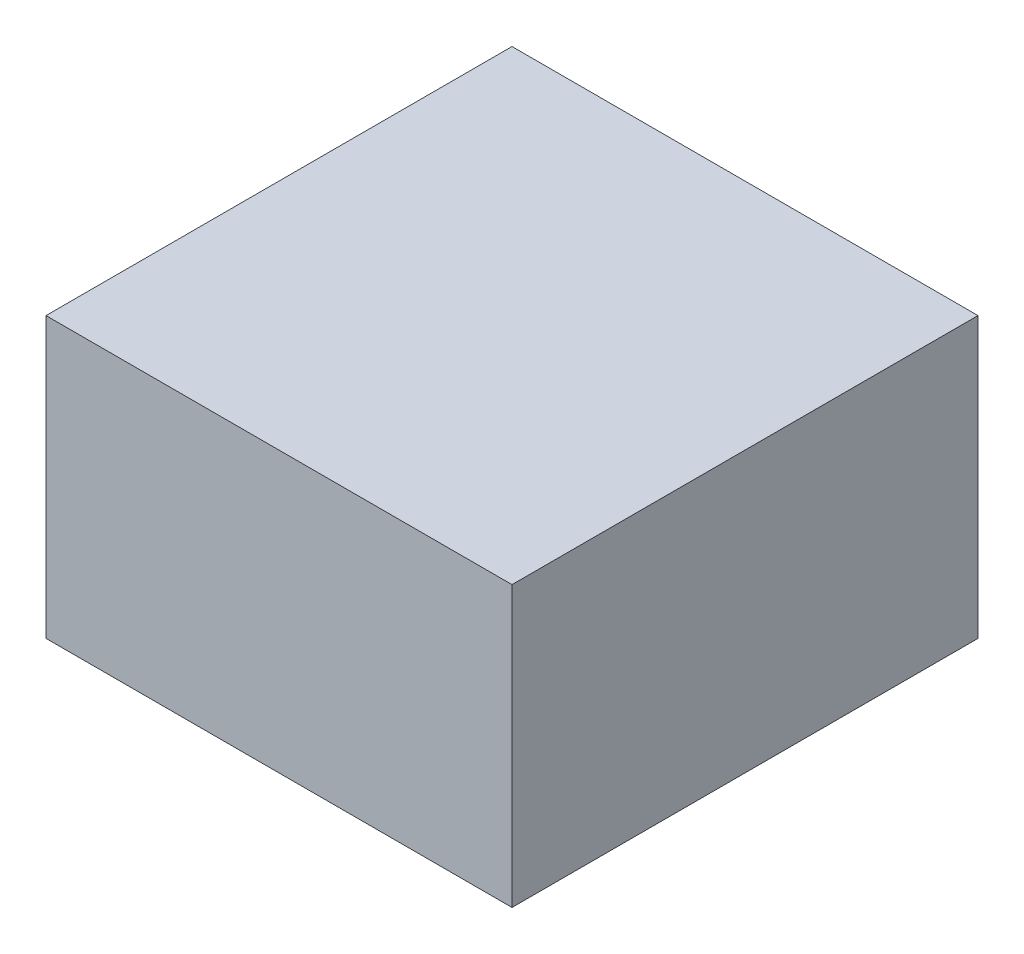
from build123d import *

# Parameters (mm, degrees)
ESQUISSE1_W      = 60
ESQUISSE1_H      = 36
EXTRUSION1_DEPTH = 30


with BuildPart() as part:
    # Esquisse1 → Extrusion1 (new, symmetric)
    with BuildSketch(Plane.XY):
        with Locations((30, 18)):
            Rectangle(ESQUISSE1_W, ESQUISSE1_H)
    extrude(amount=EXTRUSION1_DEPTH, both=True)


solid = part.part
